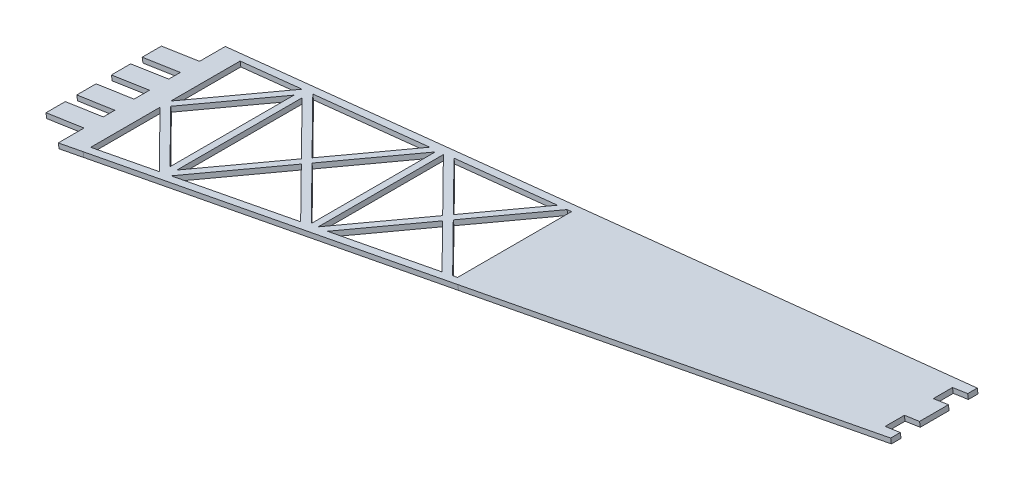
from build123d import *

# Parameters (mm, degrees)
BOSS_EXTRUDE1_DEPTH      = 114.3
CUT_EXTRUDE3_REACH       = 488.526
CUT_EXTRUDE6_DEPTH       = 487.525774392
CUT_EXTRUDE6_DEPTH_BACK  = 487.525774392
CUT_EXTRUDE8_REACH       = 488.526
SKETCH6_W                = 10
SKETCH6_H                = 12.7
BOSS_EXTRUDE5_REACH      = 1176.082
SKETCH21_W               = 5.419939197
SKETCH21_H               = 2.808055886
CUT_EXTRUDE9_START       = 0.5
SKETCH8_W                = 10
SKETCH8_H                = 19.05
SKETCH8_H_2              = 12.7
CUT_EXTRUDE9_DEPTH       = 10
CUT_EXTRUDE12_DEPTH      = 487.525774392
CUT_EXTRUDE12_DEPTH_BACK = 487.525774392
SKETCH13_W               = 5
SKETCH13_H               = 12.7
CUT_EXTRUDE13_DEPTH      = 632.34673004
BOSS_EXTRUDE2_DEPTH      = 3.175
CUT_EXTRUDE14_DEPTH      = 632.34673004
CUT_EXTRUDE14_DEPTH_BACK = 632.34673004
SKETCH16_W               = 25.4
SKETCH16_H               = 10.16
CUT_EXTRUDE16_DEPTH      = 632.34673004
CUT_EXTRUDE16_DEPTH_BACK = 632.34673004
SKETCH22_W               = 10.114785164
SKETCH22_H               = 9.05
BOSS_EXTRUDE6_DEPTH      = 3.175
BOSS_EXTRUDE7_DEPTH      = 3.175


with BuildPart() as part:
    # Sketch1 → Boss-Extrude1 (new body)
    with BuildSketch(Plane.XY):
        Polygon((465.09542005, 1072.364628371), (-98.314423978, 986.754527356), (-134.90457995, 986.754527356), (-134.90457995, 983.579527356), (-98.07457995, 983.579527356), (465.09542005, 1069.153184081), align=None)
    extrude(amount=-BOSS_EXTRUDE1_DEPTH)

    # Cut-Extrude3: up to this face of the body (flat: up to its plane)
    cut_extrude3_end = Plane(part.part.faces().sort_by_distance((183.390498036, 1029.559577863, -57.15))[0])
    # Sketch3 → Cut-Extrude3 (cut, up to the picked face)
    with BuildSketch(Plane(origin=(0, 986.754527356, 0), x_dir=(1, 0, 0), z_dir=(0, 1, 0)), mode=Mode.PRIVATE) as cut_extrude3_sk1:
        Polygon((-98.07457995, 0), (465.09542005, 28.575), (465.09542005, 0), align=None)
    cut_extrude3_tool1 = split(extrude(cut_extrude3_sk1.sketch, amount=CUT_EXTRUDE3_REACH, mode=Mode.PRIVATE), bisect_by=cut_extrude3_end, keep=Keep.BOTH, mode=Mode.PRIVATE)
    # Sketch3 → Cut-Extrude3 (cut, up to the picked face)
    with BuildSketch(Plane(origin=(0, 986.754527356, 0), x_dir=(1, 0, 0), z_dir=(0, 1, 0)), mode=Mode.PRIVATE) as cut_extrude3_sk2:
        Polygon((-98.07457995, 114.3), (465.09542005, 85.725), (465.09542005, 114.3), align=None)
    cut_extrude3_tool2 = split(extrude(cut_extrude3_sk2.sketch, amount=CUT_EXTRUDE3_REACH, mode=Mode.PRIVATE), bisect_by=cut_extrude3_end, keep=Keep.BOTH, mode=Mode.PRIVATE)
    add(cut_extrude3_tool1.solids().sort_by(Axis((277.372087, 986.754527, -9.525), (0, 1, 0)))[0], mode=Mode.SUBTRACT)
    add(cut_extrude3_tool2.solids().sort_by(Axis((277.372087, 986.754527, -104.775), (0, 1, 0)))[0], mode=Mode.SUBTRACT)

    # Sketch4 → Cut-Extrude6 (cut, two sides: drawn at the far end of the back side and taken through both)
    with BuildSketch(Plane(origin=(0, 986.754527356, 0), x_dir=(1, 0, 0), z_dir=(0, 1, 0)).offset(-CUT_EXTRUDE6_DEPTH_BACK)):
        Polygon((-98.154471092, 114.3), (-77.17954264, 114.3), (-77.17954264, 113.239794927), align=None)
        Polygon((-98.07457995, 0), (-77.17954264, 1.060205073), (-77.17954264, 0), align=None)
    extrude(amount=CUT_EXTRUDE6_DEPTH + CUT_EXTRUDE6_DEPTH_BACK, mode=Mode.SUBTRACT)

    # Cut-Extrude8: up to this plane
    cut_extrude8_end = Plane(origin=(465.09542005, 1072.364628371, -114.3), z_dir=(-0.15022558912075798, 0.9886517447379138, 0))
    # Sketch6 → Cut-Extrude8 (cut, up to the surface)
    with BuildSketch(Plane(origin=(0, 986.754527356, 0), x_dir=(1, 0, 0), z_dir=(0, 1, 0)), mode=Mode.PRIVATE) as cut_extrude8_sk1:
        with Locations((460.09542005, 73.025)):
            Rectangle(SKETCH6_W, SKETCH6_H)
    cut_extrude8_tool1 = split(extrude(cut_extrude8_sk1.sketch, amount=CUT_EXTRUDE8_REACH, mode=Mode.PRIVATE), bisect_by=cut_extrude8_end, keep=Keep.BOTH, mode=Mode.PRIVATE)
    add(cut_extrude8_tool1.solids().sort_by_distance((460.09542, 986.754527, -73.025))[0], mode=Mode.SUBTRACT)
    # Sketch6 → Cut-Extrude8 (cut, up to the surface)
    with BuildSketch(Plane(origin=(0, 986.754527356, 0), x_dir=(1, 0, 0), z_dir=(0, 1, 0)), mode=Mode.PRIVATE) as cut_extrude8_sk2:
        with Locations((460.09542005, 41.275)):
            Rectangle(SKETCH6_W, SKETCH6_H)
    cut_extrude8_tool2 = split(extrude(cut_extrude8_sk2.sketch, amount=CUT_EXTRUDE8_REACH, mode=Mode.PRIVATE), bisect_by=cut_extrude8_end, keep=Keep.BOTH, mode=Mode.PRIVATE)
    add(cut_extrude8_tool2.solids().sort_by_distance((460.09542, 986.754527, -41.275))[0], mode=Mode.SUBTRACT)

    # Sketch13 → Cut-Extrude12 (cut, two sides: drawn at the far end of the back side and taken through both)
    with BuildSketch(Plane(origin=(0, 986.754527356, 0), x_dir=(1, 0, 0), z_dir=(0, 1, 0)).offset(-CUT_EXTRUDE12_DEPTH_BACK)):
        with Locations((-132.40457995, 6.35)):
            Rectangle(SKETCH13_W, SKETCH13_H)
        with Locations((-132.40457995, 107.95)):
            Rectangle(SKETCH13_W, SKETCH13_H)
        with Locations((-132.40457995, 19.05)):
            Rectangle(SKETCH13_W, SKETCH13_H)
        with Locations((-132.40457995, 44.45)):
            Rectangle(SKETCH13_W, SKETCH13_H)
        with Locations((-132.40457995, 69.85)):
            Rectangle(SKETCH13_W, SKETCH13_H)
        with Locations((-132.40457995, 95.25)):
            Rectangle(SKETCH13_W, SKETCH13_H)
    extrude(amount=CUT_EXTRUDE12_DEPTH + CUT_EXTRUDE12_DEPTH_BACK, mode=Mode.SUBTRACT)

    # Sketch14 → Cut-Extrude13 (cut, through all)
    with BuildSketch(Plane(origin=(-148.772295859, 979.087455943, 0), x_dir=(0.988651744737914, 0.15022558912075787, 0), z_dir=(-0.15022558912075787, 0.988651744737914, 0))):
        Polygon((582.985840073, 57.149295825), (605.799221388, 34.336270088), (605.799221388, 52.625), (615.914006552, 52.625), (615.914006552, 61.675), (605.799221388, 61.675), (605.799221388, 79.963032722), align=None)
        Polygon((556.17047017, 30.333507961), (600.506810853, 32.557585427), (579.450333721, 53.613734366), align=None)
        Polygon((556.168107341, 83.966610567), (579.450278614, 60.684802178), (600.50752688, 81.742378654), align=None)
        Polygon((534.594741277, 29.251188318), (548.726021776, 29.960066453), (575.914772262, 57.149240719), (548.723530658, 84.34005851), (534.594741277, 85.048811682), align=None)
        Polygon((517.442853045, 28.390785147), (529.594741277, 29.000369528), (529.594741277, 85.299630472), (517.443340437, 85.909190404), (488.68389412, 57.149295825), align=None)
        Polygon((456.888231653, 25.353137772), (510.709505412, 28.053015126), (485.148387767, 53.613734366), align=None)
        Polygon((456.885705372, 88.946988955), (485.148332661, 60.684802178), (510.710087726, 86.246955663), align=None)
        Polygon((440.292795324, 24.52064832), (449.44378326, 24.979696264), (481.612826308, 57.149240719), (449.441128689, 89.320436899), (440.292795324, 89.77935168), align=None)
        Polygon((427.645547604, 23.886214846), (435.292795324, 24.26982953), (435.292795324, 90.03017047), (427.645901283, 90.413767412), (394.381948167, 57.149295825), align=None)
        Polygon((357.605993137, 20.372767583), (420.912199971, 23.548444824), (390.846441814, 53.613734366), align=None)
        Polygon((357.603303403, 93.927367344), (390.846386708, 60.684802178), (420.912648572, 90.751532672), align=None)
        Polygon((345.990849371, 19.790108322), (350.161544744, 19.999326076), (387.310880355, 57.149240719), (350.15872672, 94.300815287), (345.990849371, 94.509891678), align=None)
        Polygon((337.848242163, 19.381644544), (340.990849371, 19.539289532), (340.990849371, 94.760710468), (337.848462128, 94.918344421), (300.080002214, 57.149295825), align=None)
        Polygon((258.32375462, 15.392397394), (331.11489453, 19.043874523), (296.544495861, 53.613734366), align=None)
        Polygon((258.320901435, 98.907745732), (296.544440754, 60.684802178), (331.115209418, 95.256109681), align=None)
        Polygon((251.688903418, 15.828565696), (293.008934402, 57.149240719), (251.688903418, 98.468627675), align=None)
        Polygon((159.041516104, 10.412027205), (241.317589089, 14.539304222), (202.242549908, 53.613734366), align=None)
        Polygon((157.386957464, 15.828565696), (198.706988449, 57.149240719), (157.386957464, 98.468627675), align=None)
        Polygon((246.688903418, 98.060780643), (205.77805626, 57.149295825), (246.688903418, 16.239086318), align=None)
        Polygon((159.038499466, 103.88812412), (202.242494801, 60.684802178), (241.317770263, 99.76068669), align=None)
        Polygon((59.759277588, 5.431657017), (151.520283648, 10.034733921), (107.940603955, 53.613734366), align=None)
        Polygon((111.476110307, 57.149295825), (152.386957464, 16.239086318), (152.386957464, 98.060780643), align=None)
        Polygon((56.037053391, 8.780497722), (104.405042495, 57.149240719), (56.037053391, 105.516475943), align=None)
        Polygon((107.940548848, 60.684802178), (151.520331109, 104.265263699), (72.164503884, 108.246050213), (59.758593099, 108.866006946), align=None)
    extrude(amount=-CUT_EXTRUDE13_DEPTH, mode=Mode.SUBTRACT)

    # Sketch15 → Boss-Extrude2 (add)
    with BuildSketch(Plane(origin=(-148.772295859, 979.087455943, 0), x_dir=(0.988651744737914, 0.15022558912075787, 0), z_dir=(-0.15022558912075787, 0.988651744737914, 0))):
        Polygon((107.940548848, 2.842323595), (107.940548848, 9.911927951), (107.940548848, 111.457676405), (53.167814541, 114.201605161), (53.167814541, 0.094717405), align=None)
    extrude(amount=-BOSS_EXTRUDE2_DEPTH)

    # Sketch16 → Cut-Extrude14 (cut, two sides: drawn at the far end of the back side and taken through both)
    with BuildSketch(Plane(origin=(-148.772295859, 979.087455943, 0), x_dir=(0.988651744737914, 0.15022558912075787, 0), z_dir=(-0.15022558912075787, 0.988651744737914, 0)).offset(-CUT_EXTRUDE14_DEPTH_BACK)):
        Polygon((66.788801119, 0.77799728), (92.188801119, 2.052156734), (92.188801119, 19.05), (66.788801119, 19.05), align=None)
        Polygon((66.788801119, 31.75), (92.188801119, 31.75), (92.188801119, 39.37), (79.488801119, 39.37), (66.788801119, 39.37), align=None)
        with Locations((79.488801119, 57.15)):
            Rectangle(SKETCH16_W, SKETCH16_H)
        Polygon((92.188801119, 74.93), (92.188801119, 82.55), (66.788801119, 82.55), (66.788801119, 74.93), (79.488801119, 74.93), align=None)
        Polygon((92.188801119, 95.25), (92.188801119, 112.247843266), (72.414531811, 113.239794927), (66.788801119, 113.520927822), (66.788801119, 95.25), align=None)
    extrude(amount=CUT_EXTRUDE14_DEPTH + CUT_EXTRUDE14_DEPTH_BACK, mode=Mode.SUBTRACT)

    # Sketch18 → Cut-Extrude16 (cut, two sides: drawn at the far end of the back side and taken through both)
    with BuildSketch(Plane(origin=(-148.772295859, 979.087455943, 0), x_dir=(0.988651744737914, 0.150225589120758, 0), z_dir=(-0.150225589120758, 0.988651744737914, 0)).offset(-CUT_EXTRUDE16_DEPTH_BACK)):
        Polygon((66.788801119, 113.520927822), (66.788801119, 0.77799728), (66.788801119, -55.361700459), (-30.353503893, -55.361700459), (-30.353503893, 159.441057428), (66.788801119, 159.441057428), align=None)
    extrude(amount=CUT_EXTRUDE16_DEPTH + CUT_EXTRUDE16_DEPTH_BACK, mode=Mode.SUBTRACT)

    # Sketch22 → Boss-Extrude6 (add)
    with BuildSketch(Plane(origin=(-148.772295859, 979.087455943, 0), x_dir=(0.988651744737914, 0.150225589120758, 0), z_dir=(-0.150225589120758, 0.988651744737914, 0))):
        with Locations((610.85661397, 57.15)):
            Rectangle(SKETCH22_W, SKETCH22_H)
    extrude(amount=-BOSS_EXTRUDE6_DEPTH)

    # Sketch25 → Boss-Extrude7 (add)
    with BuildSketch(Plane(origin=(-148.772295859, 979.087455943, 0), x_dir=(0.988651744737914, 0.150225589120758, 0), z_dir=(-0.150225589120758, 0.988651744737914, 0))):
        Polygon((345.990849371, 99.516178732), (345.990849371, 94.509891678), (345.990849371, 14.783821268), (620.914006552, 28.575), (620.914006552, 34.925), (610.799221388, 34.925), (610.799221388, 47.625), (620.914006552, 47.625), (620.914006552, 66.675), (610.799221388, 66.675), (610.799221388, 79.375), (620.914006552, 79.375), (620.914006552, 85.725), align=None)
    extrude(amount=-BOSS_EXTRUDE7_DEPTH)


with BuildPart() as body_2:
    # Boss-Extrude5: up to this plane
    boss_extrude5_end = Plane(origin=(-98.07457995, 1596.708611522, -114.3), z_dir=(0.0506743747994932, 0, -0.9987152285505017))
    # Sketch21 → Boss-Extrude5 (new, up to the surface)
    with BuildSketch(Plane(origin=(-0.251844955, 0, -4.963482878), x_dir=(0.9987152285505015, 0, -0.05067437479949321), z_dir=(0.050674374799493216, 0, 0.9987152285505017)), mode=Mode.PRIVATE) as boss_extrude5_sk1:
        with Locations((463.216973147, 1075.462397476)):
            Rectangle(SKETCH21_W, SKETCH21_H)
    boss_extrude5_tool1 = split(extrude(boss_extrude5_sk1.sketch, amount=-BOSS_EXTRUDE5_REACH, mode=Mode.PRIVATE), bisect_by=boss_extrude5_end, keep=Keep.BOTH, mode=Mode.PRIVATE)
    add(boss_extrude5_tool1.solids().sort_by_distance((462.37, 1075.462397, -28.436713))[0])

    # Sketch8 → Cut-Extrude9 (cut)
    with BuildSketch(Plane(origin=(0, 1072.354527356, 0), x_dir=(1, 0, 0), z_dir=(0, 1, 0)).offset(CUT_EXTRUDE9_START)):
        Polygon((465.09542005, 34.925), (465.09542005, 28.575), (455.09542005, 28.067604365), (455.09542005, 34.925), align=None)
        with Locations((460.09542005, 57.15)):
            Rectangle(SKETCH8_W, SKETCH8_H)
        with Locations((460.09542005, 73.025)):
            Rectangle(SKETCH8_W, SKETCH8_H_2)
        Polygon((465.09542005, 85.725), (465.09542005, 79.375), (455.09542005, 79.375), (455.09542005, 86.232395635), align=None)
        with Locations((460.09542005, 41.275)):
            Rectangle(SKETCH8_W, SKETCH8_H_2)
    extrude(amount=CUT_EXTRUDE9_DEPTH, mode=Mode.SUBTRACT)


solid = part.part
